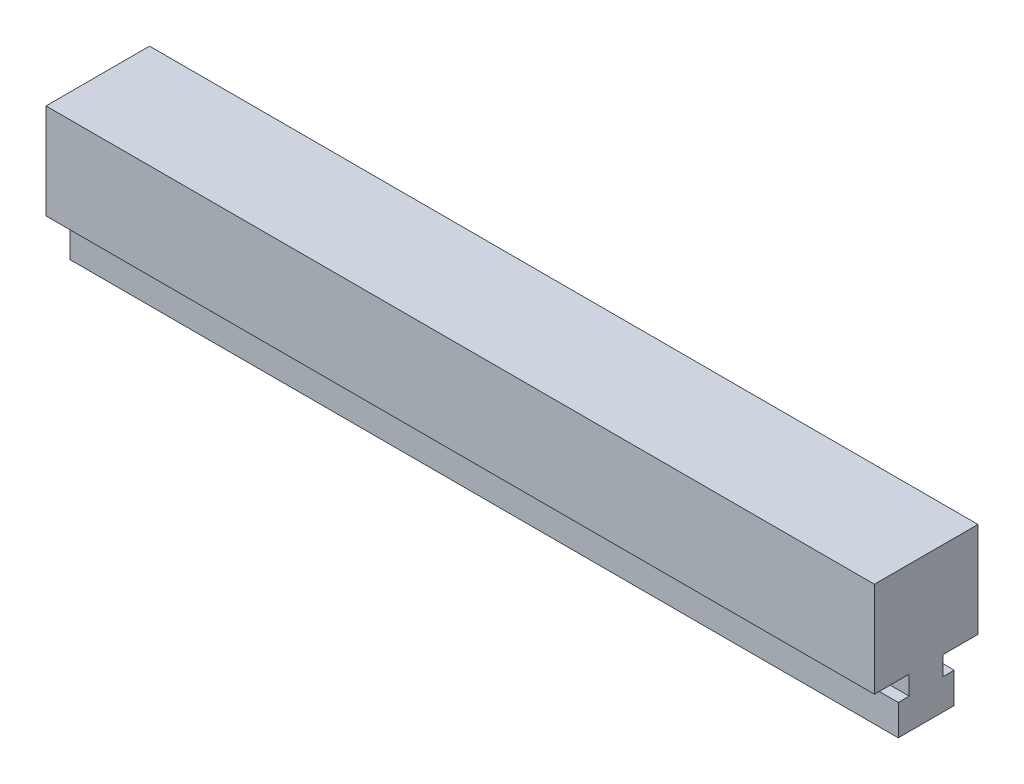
from build123d import *

# Parameters (mm, degrees)
LIUKUKISKOT_1_6033_LIUKUKISKO_23T_1_DEPTH = 200


with BuildPart() as part:
    # Sketch1 → Liukukiskot 1.6033 LIUKUKISKO 23T_1 (new body)
    with BuildSketch(Plane(origin=(0, 0, 0), x_dir=(0, 0, -1), z_dir=(1, 0, 0))):
        Polygon((12.827590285, -5.696550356), (12.827590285, 17.303442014), (-12.172409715, 17.303442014), (-12.172409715, -5.696550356), (-3.772415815, -5.696550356), (-3.772415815, -10.296548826), (-6.422409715, -10.296548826), (-6.422409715, -17.696550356), (7.077590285, -17.696550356), (7.077590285, -10.296548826), (4.427596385, -10.296548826), (4.427596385, -5.696550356), align=None)
    extrude(amount=LIUKUKISKOT_1_6033_LIUKUKISKO_23T_1_DEPTH)


solid = part.part
